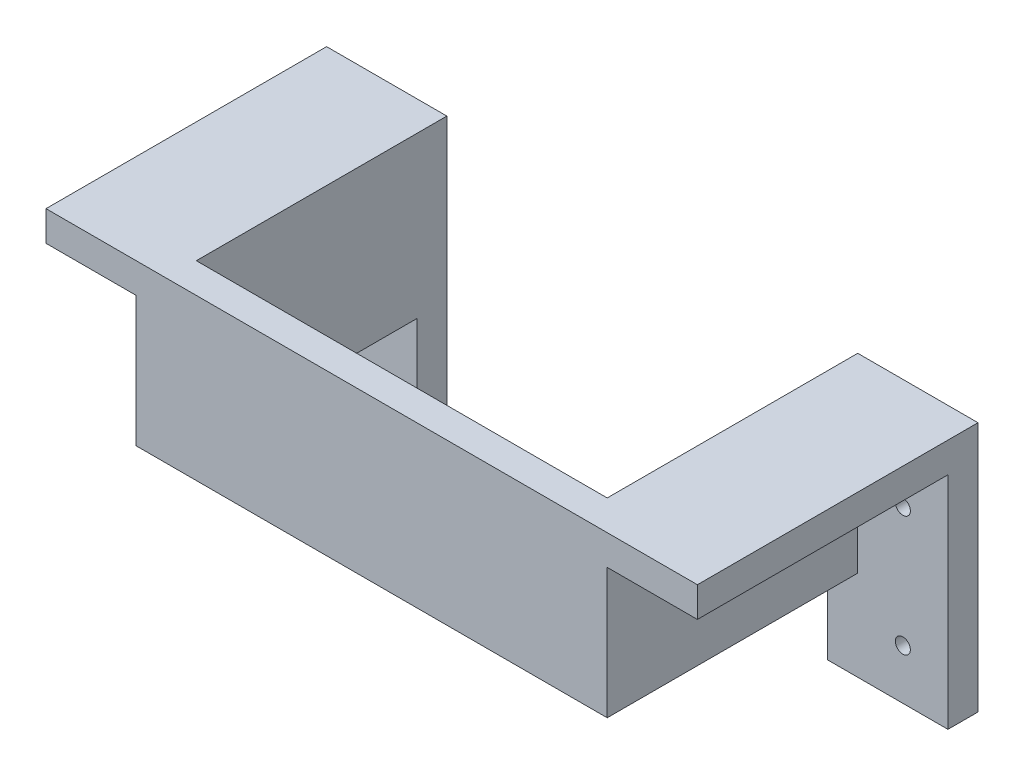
from build123d import *

# Parameters (mm, degrees)
ESQUISSE1_W             = 65
ESQUISSE1_H             = 25
BOSS_EXTRU_1_DEPTH      = 3
BOSS_EXTRU_2_DEPTH      = 25
ESQUISSE3_R             = 0.75
ENL_V_MAT_EXTRU_1_DEPTH = 74.993242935
ESQUISSE4_W             = 41
ESQUISSE4_H             = 25
ENL_V_MAT_EXTRU_2_DEPTH = 74.993242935
BOSS_EXTRU_3_REACH      = 66.946
ESQUISSE5_W             = 3
ESQUISSE5_H             = 16


with BuildPart() as part:
    # Esquisse1 → Boss.-Extru.1 (new body)
    with BuildSketch(Plane.XY):
        with Locations((-32.5, -12.5)):
            Rectangle(ESQUISSE1_W, ESQUISSE1_H)
    extrude(amount=BOSS_EXTRU_1_DEPTH)

    # Esquisse2 → Boss.-Extru.2 (add)
    with BuildSketch(Plane.XY.offset(3)):
        Polygon((-65, 0), (-53, 0), (-53, -16), (-56, -16), (-56, -3), (-65, -3), align=None)
        Polygon((0, -3), (0, 0), (-12, 0), (-12, -16), (-9, -16), (-9, -3), align=None)
    extrude(amount=BOSS_EXTRU_2_DEPTH)

    # Esquisse3 → Enl_v. mat.-Extru.1 (cut, through all)
    with BuildSketch(Plane.XY.offset(3)):
        with Locations((-60.5, -8)):
            Circle(ESQUISSE3_R)
        with Locations((-60.5, -20)):
            Circle(ESQUISSE3_R)
        with Locations(Location((-4.5, -20, 0), (0, 0, 180))):
            Circle(ESQUISSE3_R)
        with Locations(Location((-4.5, -8, 0), (0, 0, 180))):
            Circle(ESQUISSE3_R)
    extrude(amount=-ENL_V_MAT_EXTRU_1_DEPTH, mode=Mode.SUBTRACT)

    # Esquisse4 → Enl_v. mat.-Extru.2 (cut, through all)
    with BuildSketch(Plane.XY.offset(3)):
        with Locations((-32.5, -12.5)):
            Rectangle(ESQUISSE4_W, ESQUISSE4_H)
    extrude(amount=-ENL_V_MAT_EXTRU_2_DEPTH, mode=Mode.SUBTRACT)


with BuildPart() as enl_v_mat_extru_2_piece_1:
    # of the separate pieces the step leaves, piece 1, a body of its own (enl_v_mat_extru_2_pieces)
    add(part.part.solids().sort_by_distance((0, 0, 28))[0])

    # Esquisse5 → Boss.-Extru.3 (add, up to next)
    with BuildSketch(Plane(origin=(-53, 0, 0), x_dir=(0, 0, -1), z_dir=(1, 0, 0)), mode=Mode.PRIVATE) as boss_extru_3_sk1:
        with Locations((-26.5, -8)):
            Rectangle(ESQUISSE5_W, ESQUISSE5_H)
    boss_extru_3_tool1 = extrude(boss_extru_3_sk1.sketch, amount=BOSS_EXTRU_3_REACH, mode=Mode.PRIVATE) - enl_v_mat_extru_2_piece_1.part


with BuildPart() as enl_v_mat_extru_2_piece_2:
    # of the separate pieces the step leaves, piece 2, a body of its own (enl_v_mat_extru_2_pieces)
    add(part.part.solids().sort_by_distance((-53, 0, 0))[0])


with BuildPart() as enl_v_mat_extru_2_piece_1_1:
    add(enl_v_mat_extru_2_piece_1.part)

    add(enl_v_mat_extru_2_piece_2.part)  # Boss.-Extru.3 merges Enl_v. mat.-Extru.2 piece 2
    add(boss_extru_3_tool1.solids().sort_by_distance((-53, -8, 26.5))[0])


solid = enl_v_mat_extru_2_piece_1_1.part
